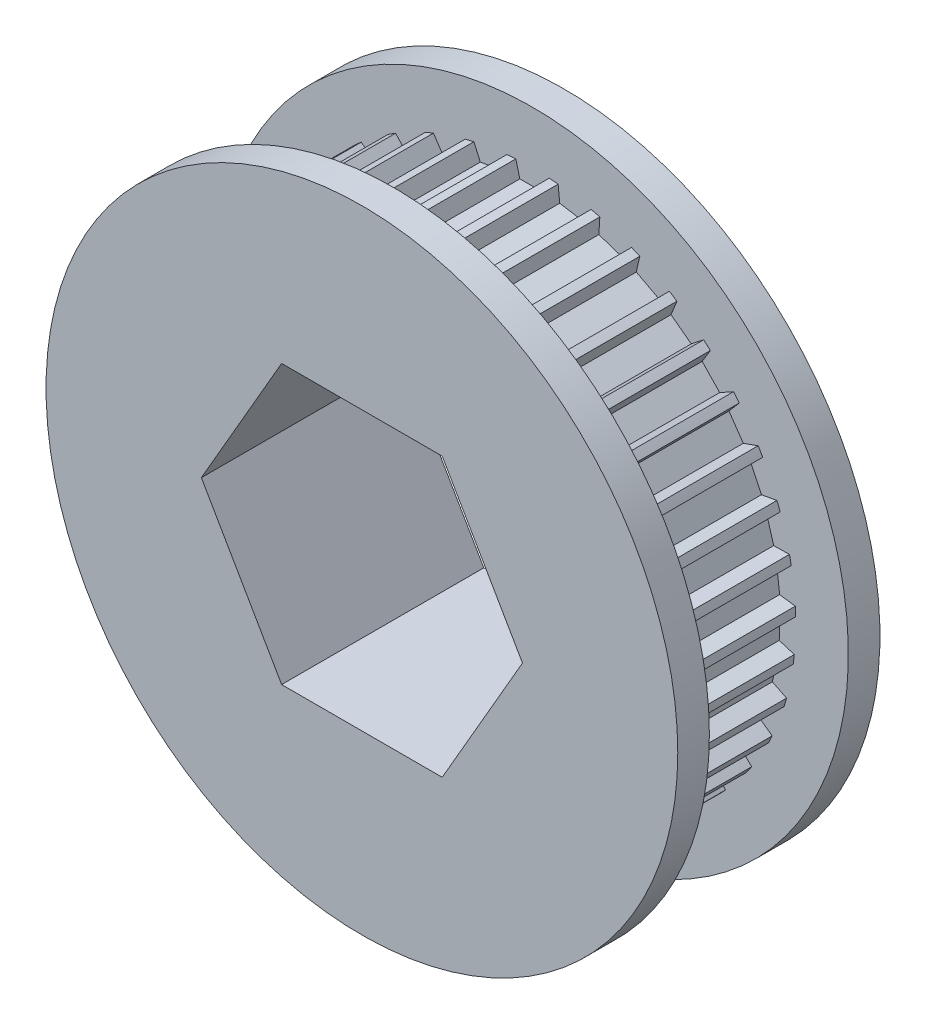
from build123d import *

# Parameters (mm, degrees)
SKETCH1_R               = 12.5
BOSS_EXTRUDE1_DEPTH     = 3.3
CUT_EXTRUDE1_START      = -6.6
CUT_EXTRUDE1_DEPTH      = 26.469552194
CIRPATTERN2_COUNT       = 39
SKETCH2_R               = 15
BOSS_EXTRUDE3_DEPTH     = 1.5
BOSS_EXTRUDE4_START     = 1.5
SKETCH3_R               = 14.999999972
BOSS_EXTRUDE4_DEPTH     = 1.5
CUT_EXTRUDE2_DEPTH      = 24.284329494
CUT_EXTRUDE2_DEPTH_BACK = 24.284329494


with BuildPart() as part:
    # Sketch1 → Boss-Extrude1 (new, symmetric)
    with BuildSketch(Plane.XY):
        Circle(SKETCH1_R)
    extrude(amount=BOSS_EXTRUDE1_DEPTH, both=True)

    # Sketch4 → Cut-Extrude1 (cut)
    with BuildSketch(Plane.XY.offset(3.3).offset(CUT_EXTRUDE1_START)):
        Polygon((-0.6, 11.75), (0.6, 11.75), (0.8, 12.5), (-0.8, 12.5), align=None)
    cut_extrude1 = extrude(amount=CUT_EXTRUDE1_DEPTH, mode=Mode.SUBTRACT)

    # CirPattern2: Cut-Extrude1 ×39 about axis
    cirpattern2_axis = Axis((0, 0, 0), (0, 0, 1))
    for i in range(1, CIRPATTERN2_COUNT):
        add(cut_extrude1.rotate(cirpattern2_axis, i * 360 / CIRPATTERN2_COUNT), mode=Mode.SUBTRACT)

    # Sketch2 → Boss-Extrude3 (add)
    with BuildSketch(Plane(origin=(0, 0, -3.3), x_dir=(-1, 0, 0), z_dir=(0, 0, -1))):
        Circle(SKETCH2_R)
    extrude(amount=BOSS_EXTRUDE3_DEPTH)

    # Sketch3 → Boss-Extrude4 (add)
    with BuildSketch(Plane.XY.offset(3.3).offset(BOSS_EXTRUDE4_START)):
        with Locations(Location((0, 0, 0), (0, 0, 180))):
            Circle(SKETCH3_R)
    extrude(amount=-BOSS_EXTRUDE4_DEPTH)

    # Sketch5 → Cut-Extrude2 (cut, two sides: drawn at the far end of the back side and taken through both)
    with BuildSketch(Plane.XY.offset(4.8).offset(-CUT_EXTRUDE2_DEPTH_BACK)):
        Polygon((7.625, 0), (3.8125, 6.603443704), (-3.8125, 6.603443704), (-7.625, 0), (-3.8125, -6.603443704), (3.8125, -6.603443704), align=None)
    extrude(amount=CUT_EXTRUDE2_DEPTH + CUT_EXTRUDE2_DEPTH_BACK, mode=Mode.SUBTRACT)


solid = part.part
